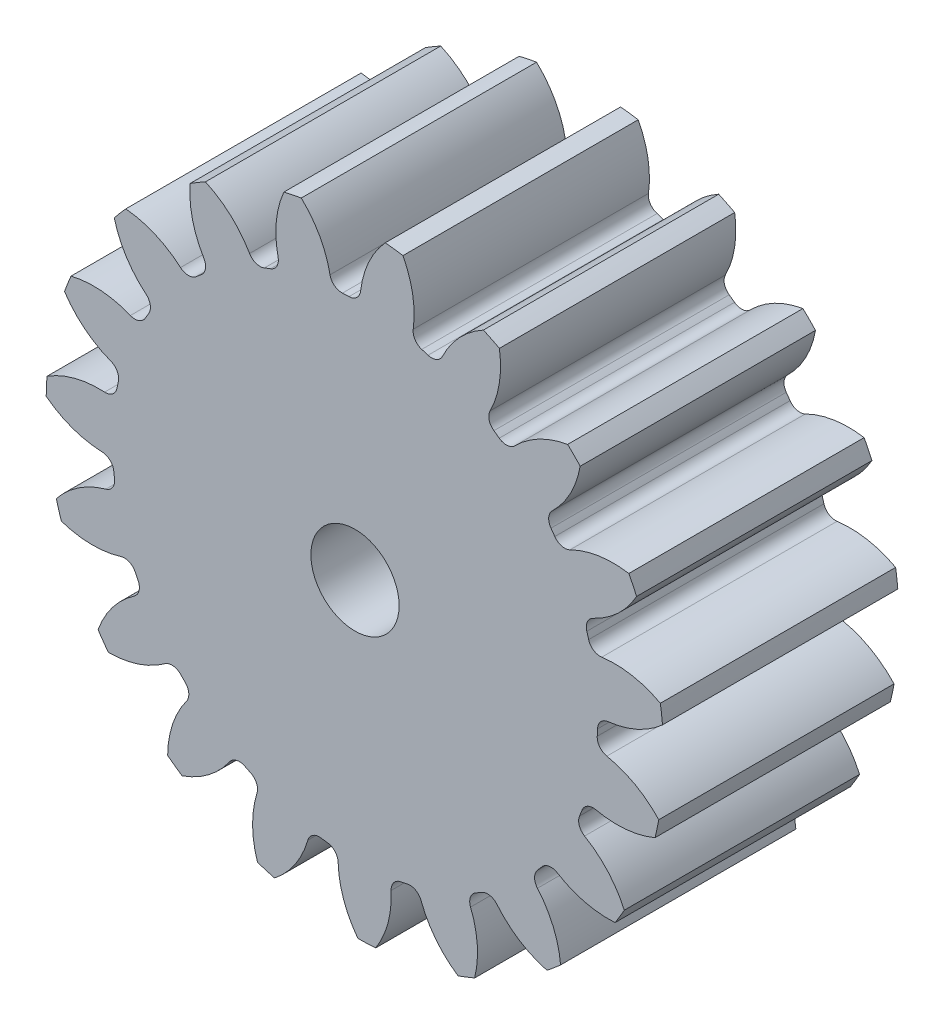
from build123d import *

# Parameters (mm, degrees)
SKETCH3_R         = 133.35
GEARBODY_DEPTH    = 101.6
TOOTHCUT_DEPTH    = 215.212522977
CIRPATTERN1_COUNT = 19
BOREDIA_R         = 19.05
BORE_DEPTH        = 12700


with BuildPart() as part:
    # Sketch3 → gearBody (new body)
    with BuildSketch(Plane.XY):
        Circle(SKETCH3_R)
    extrude(amount=GEARBODY_DEPTH)

    # Sketch2 → toothCut (cut, through all)
    with BuildSketch(Plane.XY):
        with BuildLine():
            ThreePointArc((104.599372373, -6.063985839), (104.671941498, -4.645996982), (104.725288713, -3.227154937))
            ThreePointArc((104.725288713, -3.227154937), (106.095613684, 0.121769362), (109.326251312, 1.751513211))
            ThreePointArc((109.326251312, 1.751513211), (122.231881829, 5.325526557), (133.35, 12.789863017))
            ThreePointArc((133.35, 12.789863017), (133.830179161, -5.940222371), (131.692440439, -24.554108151))
            ThreePointArc((131.692440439, -24.554108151), (121.279369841, -16.134082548), (108.741141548, -11.430711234))
            ThreePointArc((108.741141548, -11.430711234), (105.667600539, -9.521148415), (104.599372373, -6.063985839))
        make_face()
    toothcut = extrude(amount=TOOTHCUT_DEPTH, mode=Mode.SUBTRACT)

    # CirPattern1: toothCut ×19 about axis
    cirpattern1_axis = Axis((0, 0, 0), (0, 0, 1))
    for i in range(1, CIRPATTERN1_COUNT):
        add(toothcut.rotate(cirpattern1_axis, i * 360 / CIRPATTERN1_COUNT), mode=Mode.SUBTRACT)

    # boreDia → bore (cut, symmetric)
    with BuildSketch(Plane.XY):
        Circle(BOREDIA_R)
    extrude(amount=BORE_DEPTH, both=True, mode=Mode.SUBTRACT)


solid = part.part
